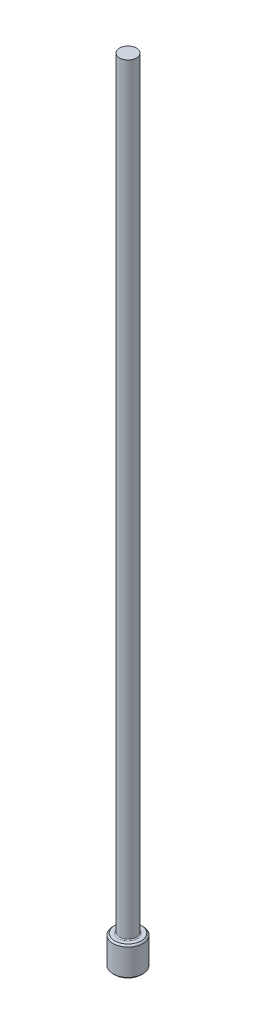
ISO-10303-21;
HEADER;
FILE_DESCRIPTION(('STEP AP214'),'2;1');
FILE_NAME('part.step','',(''),(''),'','','');
FILE_SCHEMA(('AUTOMOTIVE_DESIGN { 1 0 10303 214 1 1 1 1 }'));
ENDSEC;
DATA;
#1=APPLICATION_CONTEXT('core data for automotive mechanical design processes');
#2=APPLICATION_PROTOCOL_DEFINITION('international standard','automotive_design',2000,#1);
#3=PRODUCT_CONTEXT('',#1,'mechanical');
#4=PRODUCT('Part','Part','',(#3));
#5=PRODUCT_RELATED_PRODUCT_CATEGORY('part','',(#4));
#6=PRODUCT_DEFINITION_FORMATION('','',#4);
#7=PRODUCT_DEFINITION_CONTEXT('part definition',#1,'design');
#8=PRODUCT_DEFINITION('design','',#6,#7);
#9=PRODUCT_DEFINITION_SHAPE('','',#8);
#10=(LENGTH_UNIT() NAMED_UNIT(*) SI_UNIT(.MILLI.,.METRE.));
#11=(NAMED_UNIT(*) PLANE_ANGLE_UNIT() SI_UNIT($,.RADIAN.));
#12=(NAMED_UNIT(*) SI_UNIT($,.STERADIAN.) SOLID_ANGLE_UNIT());
#13=UNCERTAINTY_MEASURE_WITH_UNIT(LENGTH_MEASURE(1.E-05),#10,'distance_accuracy_value','');
#14=(GEOMETRIC_REPRESENTATION_CONTEXT(3) GLOBAL_UNCERTAINTY_ASSIGNED_CONTEXT((#13)) GLOBAL_UNIT_ASSIGNED_CONTEXT((#10,
#11,#12)) REPRESENTATION_CONTEXT('',''));
#15=CARTESIAN_POINT('',(0.,0.,0.));
#16=DIRECTION('',(0.,0.,1.));
#17=DIRECTION('',(1.,0.,0.));
#18=AXIS2_PLACEMENT_3D('',#15,#16,#17);
#19=CARTESIAN_POINT('',(0.,0.,0.));
#20=DIRECTION('',(0.,-1.,0.));
#21=DIRECTION('',(0.,0.,-1.));
#22=AXIS2_PLACEMENT_3D('',#19,#20,#21);
#23=PLANE('',#22);
#24=CARTESIAN_POINT('',(0.,0.,0.));
#25=DIRECTION('',(0.,-1.,0.));
#26=DIRECTION('',(0.,0.,-1.));
#27=AXIS2_PLACEMENT_3D('',#24,#25,#26);
#28=CIRCLE('',#27,1.06679999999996);
#29=CARTESIAN_POINT('',(0.,0.,-1.06679999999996));
#30=VERTEX_POINT('',#29);
#31=EDGE_CURVE('E46',#30,#30,#28,.T.);
#32=ORIENTED_EDGE('',*,*,#31,.T.);
#33=EDGE_LOOP('',(#32));
#34=FACE_BOUND('',#33,.T.);
#35=ADVANCED_FACE('F35',(#34),#23,.T.);
#36=CARTESIAN_POINT('',(0.,259.958771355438,0.));
#37=DIRECTION('',(0.,1.,0.));
#38=DIRECTION('',(0.,0.,1.));
#39=AXIS2_PLACEMENT_3D('',#36,#37,#38);
#40=CYLINDRICAL_SURFACE('',#39,1.19379999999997);
#41=CARTESIAN_POINT('',(0.,2.23519999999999,0.));
#42=DIRECTION('',(0.,1.,0.));
#43=DIRECTION('',(0.,0.,1.));
#44=AXIS2_PLACEMENT_3D('',#41,#42,#43);
#45=CIRCLE('',#44,1.19379999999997);
#46=CARTESIAN_POINT('',(0.,2.23519999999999,1.19379999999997));
#47=VERTEX_POINT('',#46);
#48=EDGE_CURVE('E50',#47,#47,#45,.F.);
#49=ORIENTED_EDGE('',*,*,#48,.T.);
#50=EDGE_LOOP('',(#49));
#51=FACE_BOUND('',#50,.T.);
#52=CARTESIAN_POINT('',(0.,0.126999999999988,0.));
#53=DIRECTION('',(0.,-1.,0.));
#54=DIRECTION('',(0.,0.,-1.));
#55=AXIS2_PLACEMENT_3D('',#52,#53,#54);
#56=CIRCLE('',#55,1.19379999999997);
#57=CARTESIAN_POINT('',(0.,0.126999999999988,-1.19379999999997));
#58=VERTEX_POINT('',#57);
#59=EDGE_CURVE('E55',#58,#58,#56,.F.);
#60=ORIENTED_EDGE('',*,*,#59,.T.);
#61=EDGE_LOOP('',(#60));
#62=FACE_BOUND('',#61,.T.);
#63=ADVANCED_FACE('F77',(#51,#62),#40,.T.);
#64=CARTESIAN_POINT('',(-1.19379999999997,2.3622,0.));
#65=DIRECTION('',(0.,1.,0.));
#66=DIRECTION('',(0.,0.,1.));
#67=AXIS2_PLACEMENT_3D('',#64,#65,#66);
#68=PLANE('',#67);
#69=CARTESIAN_POINT('',(0.,2.3622,0.));
#70=DIRECTION('',(0.,1.,0.));
#71=DIRECTION('',(0.,0.,1.));
#72=AXIS2_PLACEMENT_3D('',#69,#70,#71);
#73=CIRCLE('',#72,0.761999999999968);
#74=CARTESIAN_POINT('',(0.,2.3622,0.761999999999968));
#75=VERTEX_POINT('',#74);
#76=EDGE_CURVE('E10',#75,#75,#73,.F.);
#77=ORIENTED_EDGE('',*,*,#76,.T.);
#78=EDGE_LOOP('',(#77));
#79=FACE_BOUND('',#78,.T.);
#80=CARTESIAN_POINT('',(0.,2.3622,0.));
#81=DIRECTION('',(0.,1.,0.));
#82=DIRECTION('',(0.,0.,1.));
#83=AXIS2_PLACEMENT_3D('',#80,#81,#82);
#84=CIRCLE('',#83,1.06679999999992);
#85=CARTESIAN_POINT('',(0.,2.3622,1.06679999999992));
#86=VERTEX_POINT('',#85);
#87=EDGE_CURVE('E58',#86,#86,#84,.T.);
#88=ORIENTED_EDGE('',*,*,#87,.T.);
#89=EDGE_LOOP('',(#88));
#90=FACE_BOUND('',#89,.T.);
#91=ADVANCED_FACE('F69',(#79,#90),#68,.T.);
#92=CARTESIAN_POINT('',(0.,259.958771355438,0.));
#93=DIRECTION('',(0.,1.,0.));
#94=DIRECTION('',(0.,0.,1.));
#95=AXIS2_PLACEMENT_3D('',#92,#93,#94);
#96=CYLINDRICAL_SURFACE('',#95,0.685799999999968);
#97=CARTESIAN_POINT('',(0.,2.43840000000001,0.));
#98=DIRECTION('',(0.,1.,0.));
#99=DIRECTION('',(0.,0.,1.));
#100=AXIS2_PLACEMENT_3D('',#97,#98,#99);
#101=CIRCLE('',#100,0.685799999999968);
#102=CARTESIAN_POINT('',(0.,2.43840000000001,0.685799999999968));
#103=VERTEX_POINT('',#102);
#104=EDGE_CURVE('E42',#103,#103,#101,.T.);
#105=ORIENTED_EDGE('',*,*,#104,.T.);
#106=EDGE_LOOP('',(#105));
#107=FACE_BOUND('',#106,.T.);
#108=CARTESIAN_POINT('',(0.,63.5,0.));
#109=DIRECTION('',(0.,1.,0.));
#110=DIRECTION('',(0.,0.,1.));
#111=AXIS2_PLACEMENT_3D('',#108,#109,#110);
#112=CIRCLE('',#111,0.685799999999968);
#113=CARTESIAN_POINT('',(0.,63.5,0.685799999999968));
#114=VERTEX_POINT('',#113);
#115=EDGE_CURVE('E61',#114,#114,#112,.T.);
#116=ORIENTED_EDGE('',*,*,#115,.F.);
#117=EDGE_LOOP('',(#116));
#118=FACE_BOUND('',#117,.T.);
#119=ADVANCED_FACE('F67',(#107,#118),#96,.T.);
#120=CARTESIAN_POINT('',(-0.685799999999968,63.5,0.));
#121=DIRECTION('',(0.,1.,0.));
#122=DIRECTION('',(0.,0.,1.));
#123=AXIS2_PLACEMENT_3D('',#120,#121,#122);
#124=PLANE('',#123);
#125=ORIENTED_EDGE('',*,*,#115,.T.);
#126=EDGE_LOOP('',(#125));
#127=FACE_BOUND('',#126,.T.);
#128=ADVANCED_FACE('F65',(#127),#124,.T.);
#129=CARTESIAN_POINT('',(0.,2.36219999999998,0.));
#130=DIRECTION('',(0.,-1.,0.));
#131=DIRECTION('',(0.,0.,-1.));
#132=AXIS2_PLACEMENT_3D('',#129,#130,#131);
#133=CONICAL_SURFACE('',#132,1.06679999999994,0.785398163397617);
#134=ORIENTED_EDGE('',*,*,#48,.F.);
#135=EDGE_LOOP('',(#134));
#136=FACE_BOUND('',#135,.T.);
#137=ORIENTED_EDGE('',*,*,#87,.F.);
#138=EDGE_LOOP('',(#137));
#139=FACE_BOUND('',#138,.T.);
#140=ADVANCED_FACE('F75',(#136,#139),#133,.T.);
#141=CARTESIAN_POINT('',(0.,0.126999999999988,0.));
#142=DIRECTION('',(0.,1.,0.));
#143=DIRECTION('',(0.,0.,1.));
#144=AXIS2_PLACEMENT_3D('',#141,#142,#143);
#145=CONICAL_SURFACE('',#144,1.19379999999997,0.785398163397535);
#146=ORIENTED_EDGE('',*,*,#31,.F.);
#147=EDGE_LOOP('',(#146));
#148=FACE_BOUND('',#147,.T.);
#149=ORIENTED_EDGE('',*,*,#59,.F.);
#150=EDGE_LOOP('',(#149));
#151=FACE_BOUND('',#150,.T.);
#152=ADVANCED_FACE('F89',(#148,#151),#145,.T.);
#153=CARTESIAN_POINT('',(0.,2.43840000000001,0.));
#154=DIRECTION('',(0.,1.,0.));
#155=DIRECTION('',(0.,0.,1.));
#156=AXIS2_PLACEMENT_3D('',#153,#154,#155);
#157=TOROIDAL_SURFACE('',#156,0.761999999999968,0.0762);
#158=ORIENTED_EDGE('',*,*,#76,.F.);
#159=EDGE_LOOP('',(#158));
#160=FACE_BOUND('',#159,.T.);
#161=ORIENTED_EDGE('',*,*,#104,.F.);
#162=EDGE_LOOP('',(#161));
#163=FACE_BOUND('',#162,.T.);
#164=ADVANCED_FACE('F37',(#160,#163),#157,.F.);
#165=CLOSED_SHELL('',(#35,#63,#91,#119,#128,#140,#152,#164));
#166=MANIFOLD_SOLID_BREP('B2',#165);
#167=ADVANCED_BREP_SHAPE_REPRESENTATION('',(#18,#166),#14);
#168=SHAPE_DEFINITION_REPRESENTATION(#9,#167);
ENDSEC;
END-ISO-10303-21;
